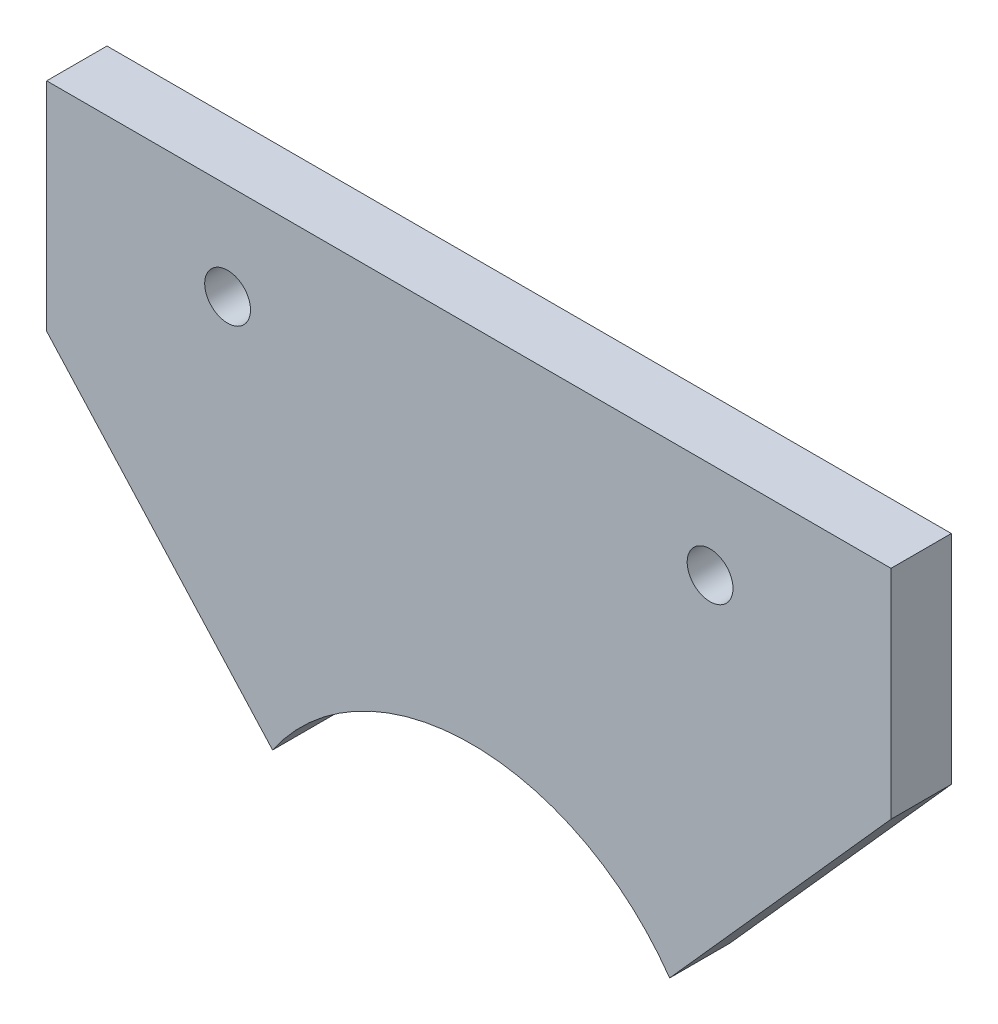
ISO-10303-21;
HEADER;
FILE_DESCRIPTION(('STEP AP214'),'2;1');
FILE_NAME('part.step','',(''),(''),'','','');
FILE_SCHEMA(('AUTOMOTIVE_DESIGN { 1 0 10303 214 1 1 1 1 }'));
ENDSEC;
DATA;
#1=APPLICATION_CONTEXT('core data for automotive mechanical design processes');
#2=APPLICATION_PROTOCOL_DEFINITION('international standard','automotive_design',2000,#1);
#3=PRODUCT_CONTEXT('',#1,'mechanical');
#4=PRODUCT('Part','Part','',(#3));
#5=PRODUCT_RELATED_PRODUCT_CATEGORY('part','',(#4));
#6=PRODUCT_DEFINITION_FORMATION('','',#4);
#7=PRODUCT_DEFINITION_CONTEXT('part definition',#1,'design');
#8=PRODUCT_DEFINITION('design','',#6,#7);
#9=PRODUCT_DEFINITION_SHAPE('','',#8);
#10=(LENGTH_UNIT() NAMED_UNIT(*) SI_UNIT(.MILLI.,.METRE.));
#11=(NAMED_UNIT(*) PLANE_ANGLE_UNIT() SI_UNIT($,.RADIAN.));
#12=(NAMED_UNIT(*) SI_UNIT($,.STERADIAN.) SOLID_ANGLE_UNIT());
#13=UNCERTAINTY_MEASURE_WITH_UNIT(LENGTH_MEASURE(1.E-05),#10,'distance_accuracy_value','');
#14=(GEOMETRIC_REPRESENTATION_CONTEXT(3) GLOBAL_UNCERTAINTY_ASSIGNED_CONTEXT((#13)) GLOBAL_UNIT_ASSIGNED_CONTEXT((#10,
#11,#12)) REPRESENTATION_CONTEXT('',''));
#15=CARTESIAN_POINT('',(0.,0.,0.));
#16=DIRECTION('',(0.,0.,1.));
#17=DIRECTION('',(1.,0.,0.));
#18=AXIS2_PLACEMENT_3D('',#15,#16,#17);
#19=CARTESIAN_POINT('',(35.,-25.,5.));
#20=DIRECTION('',(-1.,0.,0.));
#21=DIRECTION('',(0.,0.,1.));
#22=AXIS2_PLACEMENT_3D('',#19,#20,#21);
#23=PLANE('',#22);
#24=DIRECTION('',(0.,1.,0.));
#25=VECTOR('',#24,1.);
#26=CARTESIAN_POINT('',(35.,-25.,5.));
#27=LINE('',#26,#25);
#28=CARTESIAN_POINT('',(35.,6.98483303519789,5.));
#29=VERTEX_POINT('',#28);
#30=CARTESIAN_POINT('',(35.,25.,5.));
#31=VERTEX_POINT('',#30);
#32=EDGE_CURVE('E121',#29,#31,#27,.T.);
#33=ORIENTED_EDGE('',*,*,#32,.F.);
#34=DIRECTION('',(0.,0.,-1.));
#35=VECTOR('',#34,1.);
#36=CARTESIAN_POINT('',(35.,6.98483303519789,5.));
#37=LINE('',#36,#35);
#38=CARTESIAN_POINT('',(35.,6.98483303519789,0.));
#39=VERTEX_POINT('',#38);
#40=EDGE_CURVE('E100',#29,#39,#37,.T.);
#41=ORIENTED_EDGE('',*,*,#40,.T.);
#42=DIRECTION('',(0.,1.,0.));
#43=VECTOR('',#42,1.);
#44=CARTESIAN_POINT('',(35.,-25.,0.));
#45=LINE('',#44,#43);
#46=CARTESIAN_POINT('',(35.,25.,0.));
#47=VERTEX_POINT('',#46);
#48=EDGE_CURVE('E120',#39,#47,#45,.T.);
#49=ORIENTED_EDGE('',*,*,#48,.T.);
#50=DIRECTION('',(0.,0.,-1.));
#51=VECTOR('',#50,1.);
#52=CARTESIAN_POINT('',(35.,25.,5.));
#53=LINE('',#52,#51);
#54=EDGE_CURVE('E136',#31,#47,#53,.T.);
#55=ORIENTED_EDGE('',*,*,#54,.F.);
#56=EDGE_LOOP('',(#33,#41,#49,#55));
#57=FACE_BOUND('',#56,.T.);
#58=ADVANCED_FACE('F33',(#57),#23,.F.);
#59=CARTESIAN_POINT('',(-35.,25.,5.));
#60=DIRECTION('',(0.,-1.,0.));
#61=DIRECTION('',(0.,0.,-1.));
#62=AXIS2_PLACEMENT_3D('',#59,#60,#61);
#63=PLANE('',#62);
#64=DIRECTION('',(-1.,0.,0.));
#65=VECTOR('',#64,1.);
#66=CARTESIAN_POINT('',(-35.,25.,0.));
#67=LINE('',#66,#65);
#68=CARTESIAN_POINT('',(-35.,25.,0.));
#69=VERTEX_POINT('',#68);
#70=EDGE_CURVE('E130',#47,#69,#67,.T.);
#71=ORIENTED_EDGE('',*,*,#70,.T.);
#72=DIRECTION('',(0.,0.,-1.));
#73=VECTOR('',#72,1.);
#74=CARTESIAN_POINT('',(-35.,25.,5.));
#75=LINE('',#74,#73);
#76=CARTESIAN_POINT('',(-35.,25.,5.));
#77=VERTEX_POINT('',#76);
#78=EDGE_CURVE('E128',#77,#69,#75,.T.);
#79=ORIENTED_EDGE('',*,*,#78,.F.);
#80=DIRECTION('',(-1.,0.,0.));
#81=VECTOR('',#80,1.);
#82=CARTESIAN_POINT('',(-35.,25.,5.));
#83=LINE('',#82,#81);
#84=EDGE_CURVE('E123',#31,#77,#83,.T.);
#85=ORIENTED_EDGE('',*,*,#84,.F.);
#86=ORIENTED_EDGE('',*,*,#54,.T.);
#87=EDGE_LOOP('',(#71,#79,#85,#86));
#88=FACE_BOUND('',#87,.T.);
#89=ADVANCED_FACE('F151',(#88),#63,.F.);
#90=CARTESIAN_POINT('',(-35.,-25.,5.));
#91=DIRECTION('',(1.,0.,0.));
#92=DIRECTION('',(0.,0.,-1.));
#93=AXIS2_PLACEMENT_3D('',#90,#91,#92);
#94=PLANE('',#93);
#95=DIRECTION('',(0.,-1.,0.));
#96=VECTOR('',#95,1.);
#97=CARTESIAN_POINT('',(-35.,-25.,0.));
#98=LINE('',#97,#96);
#99=CARTESIAN_POINT('',(-35.,7.01679844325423,0.));
#100=VERTEX_POINT('',#99);
#101=EDGE_CURVE('E124',#69,#100,#98,.T.);
#102=ORIENTED_EDGE('',*,*,#101,.T.);
#103=DIRECTION('',(0.,0.,1.));
#104=VECTOR('',#103,1.);
#105=CARTESIAN_POINT('',(-35.,7.01679844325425,5.));
#106=LINE('',#105,#104);
#107=CARTESIAN_POINT('',(-35.,7.01679844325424,5.));
#108=VERTEX_POINT('',#107);
#109=EDGE_CURVE('E54',#100,#108,#106,.T.);
#110=ORIENTED_EDGE('',*,*,#109,.T.);
#111=DIRECTION('',(0.,-1.,0.));
#112=VECTOR('',#111,1.);
#113=CARTESIAN_POINT('',(-35.,-25.,5.));
#114=LINE('',#113,#112);
#115=EDGE_CURVE('E126',#77,#108,#114,.T.);
#116=ORIENTED_EDGE('',*,*,#115,.F.);
#117=ORIENTED_EDGE('',*,*,#78,.T.);
#118=EDGE_LOOP('',(#102,#110,#116,#117));
#119=FACE_BOUND('',#118,.T.);
#120=ADVANCED_FACE('F154',(#119),#94,.F.);
#121=CARTESIAN_POINT('',(35.,25.,5.));
#122=DIRECTION('',(0.,0.,-1.));
#123=DIRECTION('',(-1.,0.,0.));
#124=AXIS2_PLACEMENT_3D('',#121,#122,#123);
#125=PLANE('',#124);
#126=CARTESIAN_POINT('',(-20.,17.,5.));
#127=DIRECTION('',(0.,0.,1.));
#128=DIRECTION('',(1.,0.,0.));
#129=AXIS2_PLACEMENT_3D('',#126,#127,#128);
#130=CIRCLE('',#129,1.89864999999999);
#131=CARTESIAN_POINT('',(-18.10135,17.,5.));
#132=VERTEX_POINT('',#131);
#133=EDGE_CURVE('E108',#132,#132,#130,.T.);
#134=ORIENTED_EDGE('',*,*,#133,.F.);
#135=EDGE_LOOP('',(#134));
#136=FACE_BOUND('',#135,.T.);
#137=CARTESIAN_POINT('',(20.,17.,5.));
#138=DIRECTION('',(0.,0.,1.));
#139=DIRECTION('',(1.,0.,0.));
#140=AXIS2_PLACEMENT_3D('',#137,#138,#139);
#141=CIRCLE('',#140,1.89864999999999);
#142=CARTESIAN_POINT('',(21.89865,17.,5.));
#143=VERTEX_POINT('',#142);
#144=EDGE_CURVE('E114',#143,#143,#141,.T.);
#145=ORIENTED_EDGE('',*,*,#144,.F.);
#146=EDGE_LOOP('',(#145));
#147=FACE_BOUND('',#146,.T.);
#148=DIRECTION('',(-0.670913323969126,0.741535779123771,0.));
#149=VECTOR('',#148,1.);
#150=CARTESIAN_POINT('',(-37.0147135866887,9.24358714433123,5.));
#151=LINE('',#150,#149);
#152=CARTESIAN_POINT('',(-16.2712274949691,-13.6834237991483,5.));
#153=VERTEX_POINT('',#152);
#154=EDGE_CURVE('E96',#153,#108,#151,.T.);
#155=ORIENTED_EDGE('',*,*,#154,.F.);
#156=CARTESIAN_POINT('',(0.219227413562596,-25.,5.));
#157=DIRECTION('',(0.,0.,1.));
#158=DIRECTION('',(1.,0.,0.));
#159=AXIS2_PLACEMENT_3D('',#156,#157,#158);
#160=CIRCLE('',#159,20.);
#161=CARTESIAN_POINT('',(16.6464645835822,-13.591850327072,5.));
#162=VERTEX_POINT('',#161);
#163=EDGE_CURVE('E84',#162,#153,#160,.T.);
#164=ORIENTED_EDGE('',*,*,#163,.F.);
#165=DIRECTION('',(-0.665642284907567,-0.746270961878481,0.));
#166=VECTOR('',#165,1.);
#167=CARTESIAN_POINT('',(37.0147135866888,9.24358714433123,5.));
#168=LINE('',#167,#166);
#169=EDGE_CURVE('E93',#29,#162,#168,.T.);
#170=ORIENTED_EDGE('',*,*,#169,.F.);
#171=ORIENTED_EDGE('',*,*,#32,.T.);
#172=ORIENTED_EDGE('',*,*,#84,.T.);
#173=ORIENTED_EDGE('',*,*,#115,.T.);
#174=EDGE_LOOP('',(#155,#164,#170,#171,#172,#173));
#175=FACE_BOUND('',#174,.T.);
#176=ADVANCED_FACE('F92',(#136,#147,#175),#125,.F.);
#177=CARTESIAN_POINT('',(35.,25.,0.));
#178=DIRECTION('',(0.,0.,-1.));
#179=DIRECTION('',(-1.,0.,0.));
#180=AXIS2_PLACEMENT_3D('',#177,#178,#179);
#181=PLANE('',#180);
#182=CARTESIAN_POINT('',(0.219227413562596,-25.,0.));
#183=DIRECTION('',(0.,0.,1.));
#184=DIRECTION('',(1.,0.,0.));
#185=AXIS2_PLACEMENT_3D('',#182,#183,#184);
#186=CIRCLE('',#185,20.);
#187=CARTESIAN_POINT('',(16.6464645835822,-13.591850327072,0.));
#188=VERTEX_POINT('',#187);
#189=CARTESIAN_POINT('',(-16.2712274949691,-13.6834237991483,0.));
#190=VERTEX_POINT('',#189);
#191=EDGE_CURVE('E47',#188,#190,#186,.T.);
#192=ORIENTED_EDGE('',*,*,#191,.T.);
#193=DIRECTION('',(0.670913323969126,-0.741535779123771,0.));
#194=VECTOR('',#193,1.);
#195=CARTESIAN_POINT('',(-12.4380267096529,-17.9201194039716,0.));
#196=LINE('',#195,#194);
#197=EDGE_CURVE('E139',#100,#190,#196,.T.);
#198=ORIENTED_EDGE('',*,*,#197,.F.);
#199=ORIENTED_EDGE('',*,*,#101,.F.);
#200=ORIENTED_EDGE('',*,*,#70,.F.);
#201=ORIENTED_EDGE('',*,*,#48,.F.);
#202=DIRECTION('',(0.665642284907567,0.746270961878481,0.));
#203=VECTOR('',#202,1.);
#204=CARTESIAN_POINT('',(43.949025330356,17.0178461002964,0.));
#205=LINE('',#204,#203);
#206=EDGE_CURVE('E40',#188,#39,#205,.T.);
#207=ORIENTED_EDGE('',*,*,#206,.F.);
#208=EDGE_LOOP('',(#192,#198,#199,#200,#201,#207));
#209=FACE_BOUND('',#208,.T.);
#210=CARTESIAN_POINT('',(-20.,17.,0.));
#211=DIRECTION('',(0.,0.,1.));
#212=DIRECTION('',(1.,0.,0.));
#213=AXIS2_PLACEMENT_3D('',#210,#211,#212);
#214=CIRCLE('',#213,1.89865);
#215=CARTESIAN_POINT('',(-18.10135,17.,0.));
#216=VERTEX_POINT('',#215);
#217=EDGE_CURVE('E111',#216,#216,#214,.T.);
#218=ORIENTED_EDGE('',*,*,#217,.T.);
#219=EDGE_LOOP('',(#218));
#220=FACE_BOUND('',#219,.T.);
#221=CARTESIAN_POINT('',(20.,17.,0.));
#222=DIRECTION('',(0.,0.,1.));
#223=DIRECTION('',(1.,0.,0.));
#224=AXIS2_PLACEMENT_3D('',#221,#222,#223);
#225=CIRCLE('',#224,1.89865);
#226=CARTESIAN_POINT('',(21.89865,17.,0.));
#227=VERTEX_POINT('',#226);
#228=EDGE_CURVE('E117',#227,#227,#225,.T.);
#229=ORIENTED_EDGE('',*,*,#228,.T.);
#230=EDGE_LOOP('',(#229));
#231=FACE_BOUND('',#230,.T.);
#232=ADVANCED_FACE('F145',(#209,#220,#231),#181,.T.);
#233=CARTESIAN_POINT('',(20.,17.,5.));
#234=DIRECTION('',(0.,0.,1.));
#235=DIRECTION('',(1.,0.,0.));
#236=AXIS2_PLACEMENT_3D('',#233,#234,#235);
#237=CYLINDRICAL_SURFACE('',#236,1.89864999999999);
#238=ORIENTED_EDGE('',*,*,#228,.F.);
#239=EDGE_LOOP('',(#238));
#240=FACE_BOUND('',#239,.T.);
#241=ORIENTED_EDGE('',*,*,#144,.T.);
#242=EDGE_LOOP('',(#241));
#243=FACE_BOUND('',#242,.T.);
#244=ADVANCED_FACE('F178',(#240,#243),#237,.F.);
#245=CARTESIAN_POINT('',(-20.,17.,5.));
#246=DIRECTION('',(0.,0.,1.));
#247=DIRECTION('',(1.,0.,0.));
#248=AXIS2_PLACEMENT_3D('',#245,#246,#247);
#249=CYLINDRICAL_SURFACE('',#248,1.89864999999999);
#250=ORIENTED_EDGE('',*,*,#217,.F.);
#251=EDGE_LOOP('',(#250));
#252=FACE_BOUND('',#251,.T.);
#253=ORIENTED_EDGE('',*,*,#133,.T.);
#254=EDGE_LOOP('',(#253));
#255=FACE_BOUND('',#254,.T.);
#256=ADVANCED_FACE('F182',(#252,#255),#249,.F.);
#257=CARTESIAN_POINT('',(-37.0147135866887,9.24358714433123,0.));
#258=DIRECTION('',(0.741535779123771,0.670913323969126,0.));
#259=DIRECTION('',(-0.670913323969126,0.741535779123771,0.));
#260=AXIS2_PLACEMENT_3D('',#257,#258,#259);
#261=PLANE('',#260);
#262=ORIENTED_EDGE('',*,*,#197,.T.);
#263=DIRECTION('',(0.,0.,1.));
#264=VECTOR('',#263,1.);
#265=CARTESIAN_POINT('',(-16.2712274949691,-13.6834237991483,0.));
#266=LINE('',#265,#264);
#267=EDGE_CURVE('E101',#190,#153,#266,.T.);
#268=ORIENTED_EDGE('',*,*,#267,.T.);
#269=ORIENTED_EDGE('',*,*,#154,.T.);
#270=ORIENTED_EDGE('',*,*,#109,.F.);
#271=EDGE_LOOP('',(#262,#268,#269,#270));
#272=FACE_BOUND('',#271,.T.);
#273=ADVANCED_FACE('F193',(#272),#261,.F.);
#274=CARTESIAN_POINT('',(37.0147135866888,9.24358714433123,0.));
#275=DIRECTION('',(-0.746270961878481,0.665642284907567,0.));
#276=DIRECTION('',(-0.665642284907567,-0.746270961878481,0.));
#277=AXIS2_PLACEMENT_3D('',#274,#275,#276);
#278=PLANE('',#277);
#279=ORIENTED_EDGE('',*,*,#169,.T.);
#280=DIRECTION('',(0.,0.,1.));
#281=VECTOR('',#280,1.);
#282=CARTESIAN_POINT('',(16.6464645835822,-13.591850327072,0.));
#283=LINE('',#282,#281);
#284=EDGE_CURVE('E11',#162,#188,#283,.F.);
#285=ORIENTED_EDGE('',*,*,#284,.T.);
#286=ORIENTED_EDGE('',*,*,#206,.T.);
#287=ORIENTED_EDGE('',*,*,#40,.F.);
#288=EDGE_LOOP('',(#279,#285,#286,#287));
#289=FACE_BOUND('',#288,.T.);
#290=ADVANCED_FACE('F98',(#289),#278,.F.);
#291=CARTESIAN_POINT('',(0.219227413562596,-25.,0.));
#292=DIRECTION('',(0.,0.,1.));
#293=DIRECTION('',(1.,0.,0.));
#294=AXIS2_PLACEMENT_3D('',#291,#292,#293);
#295=CYLINDRICAL_SURFACE('',#294,20.);
#296=ORIENTED_EDGE('',*,*,#191,.F.);
#297=ORIENTED_EDGE('',*,*,#284,.F.);
#298=ORIENTED_EDGE('',*,*,#163,.T.);
#299=ORIENTED_EDGE('',*,*,#267,.F.);
#300=EDGE_LOOP('',(#296,#297,#298,#299));
#301=FACE_BOUND('',#300,.T.);
#302=ADVANCED_FACE('F83',(#301),#295,.F.);
#303=CLOSED_SHELL('',(#58,#89,#120,#176,#232,#244,#256,#273,#290,#302));
#304=MANIFOLD_SOLID_BREP('B2',#303);
#305=ADVANCED_BREP_SHAPE_REPRESENTATION('',(#18,#304),#14);
#306=SHAPE_DEFINITION_REPRESENTATION(#9,#305);
ENDSEC;
END-ISO-10303-21;
